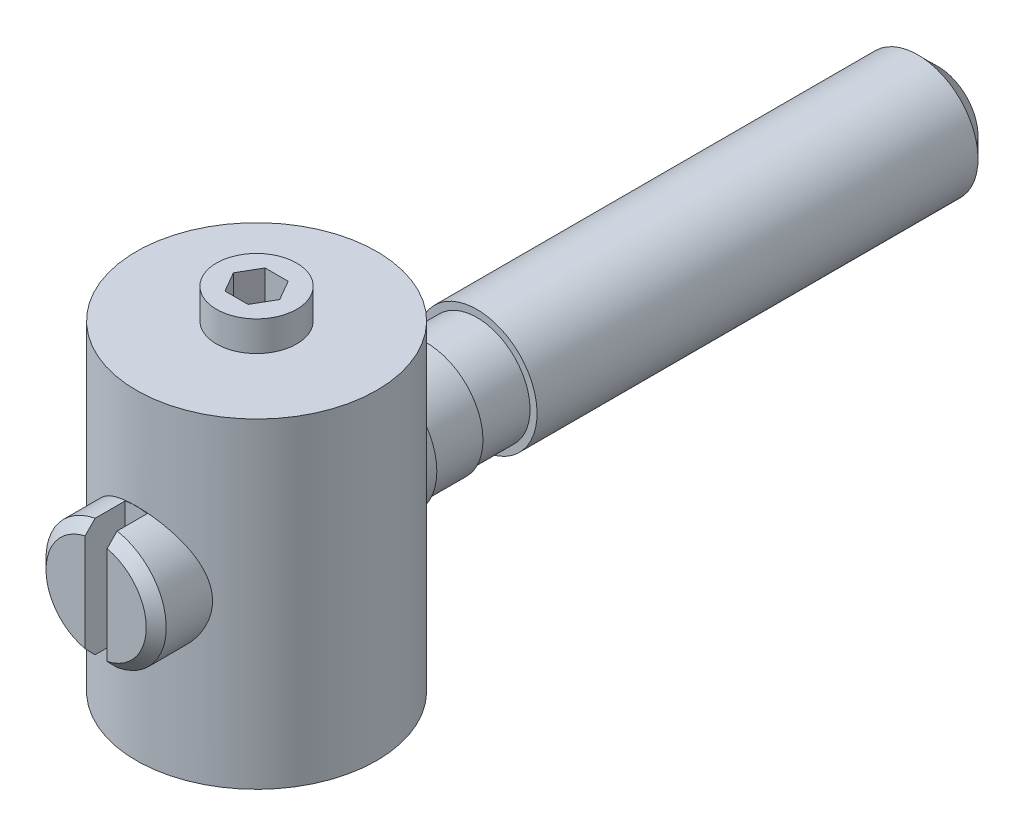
ISO-10303-21;
HEADER;
FILE_DESCRIPTION(('STEP AP214'),'2;1');
FILE_NAME('part.step','',(''),(''),'','','');
FILE_SCHEMA(('AUTOMOTIVE_DESIGN { 1 0 10303 214 1 1 1 1 }'));
ENDSEC;
DATA;
#1=APPLICATION_CONTEXT('core data for automotive mechanical design processes');
#2=APPLICATION_PROTOCOL_DEFINITION('international standard','automotive_design',2000,#1);
#3=PRODUCT_CONTEXT('',#1,'mechanical');
#4=PRODUCT('Part','Part','',(#3));
#5=PRODUCT_RELATED_PRODUCT_CATEGORY('part','',(#4));
#6=PRODUCT_DEFINITION_FORMATION('','',#4);
#7=PRODUCT_DEFINITION_CONTEXT('part definition',#1,'design');
#8=PRODUCT_DEFINITION('design','',#6,#7);
#9=PRODUCT_DEFINITION_SHAPE('','',#8);
#10=(LENGTH_UNIT() NAMED_UNIT(*) SI_UNIT(.MILLI.,.METRE.));
#11=(NAMED_UNIT(*) PLANE_ANGLE_UNIT() SI_UNIT($,.RADIAN.));
#12=(NAMED_UNIT(*) SI_UNIT($,.STERADIAN.) SOLID_ANGLE_UNIT());
#13=UNCERTAINTY_MEASURE_WITH_UNIT(LENGTH_MEASURE(1.E-05),#10,'distance_accuracy_value','');
#14=(GEOMETRIC_REPRESENTATION_CONTEXT(3) GLOBAL_UNCERTAINTY_ASSIGNED_CONTEXT((#13)) GLOBAL_UNIT_ASSIGNED_CONTEXT((#10,
#11,#12)) REPRESENTATION_CONTEXT('',''));
#15=CARTESIAN_POINT('',(0.,0.,0.));
#16=DIRECTION('',(0.,0.,1.));
#17=DIRECTION('',(1.,0.,0.));
#18=AXIS2_PLACEMENT_3D('',#15,#16,#17);
#19=CARTESIAN_POINT('',(-0.577350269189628,8.,-1.));
#20=DIRECTION('',(0.,-1.,0.));
#21=DIRECTION('',(1.,0.,0.));
#22=AXIS2_PLACEMENT_3D('',#19,#20,#21);
#23=PLANE('',#22);
#24=DIRECTION('',(-0.5,0.,0.866025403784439));
#25=VECTOR('',#24,1.);
#26=CARTESIAN_POINT('',(-0.577350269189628,8.,-1.));
#27=LINE('',#26,#25);
#28=CARTESIAN_POINT('',(-0.577350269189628,8.,-1.));
#29=VERTEX_POINT('',#28);
#30=CARTESIAN_POINT('',(-1.15470053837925,8.,0.));
#31=VERTEX_POINT('',#30);
#32=EDGE_CURVE('E366',#29,#31,#27,.T.);
#33=ORIENTED_EDGE('',*,*,#32,.T.);
#34=DIRECTION('',(0.5,0.,0.866025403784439));
#35=VECTOR('',#34,1.);
#36=CARTESIAN_POINT('',(-1.15470053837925,8.,0.));
#37=LINE('',#36,#35);
#38=CARTESIAN_POINT('',(-0.577350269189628,8.,1.));
#39=VERTEX_POINT('',#38);
#40=EDGE_CURVE('E363',#31,#39,#37,.T.);
#41=ORIENTED_EDGE('',*,*,#40,.T.);
#42=DIRECTION('',(1.,0.,0.));
#43=VECTOR('',#42,1.);
#44=CARTESIAN_POINT('',(-0.577350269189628,8.,1.));
#45=LINE('',#44,#43);
#46=CARTESIAN_POINT('',(0.577350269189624,8.,1.));
#47=VERTEX_POINT('',#46);
#48=EDGE_CURVE('E360',#39,#47,#45,.T.);
#49=ORIENTED_EDGE('',*,*,#48,.T.);
#50=DIRECTION('',(0.5,0.,-0.866025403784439));
#51=VECTOR('',#50,1.);
#52=CARTESIAN_POINT('',(0.577350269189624,8.,1.));
#53=LINE('',#52,#51);
#54=CARTESIAN_POINT('',(1.15470053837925,8.,0.));
#55=VERTEX_POINT('',#54);
#56=EDGE_CURVE('E357',#47,#55,#53,.T.);
#57=ORIENTED_EDGE('',*,*,#56,.T.);
#58=DIRECTION('',(-0.5,0.,-0.866025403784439));
#59=VECTOR('',#58,1.);
#60=CARTESIAN_POINT('',(1.15470053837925,8.,0.));
#61=LINE('',#60,#59);
#62=CARTESIAN_POINT('',(0.577350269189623,8.,-1.));
#63=VERTEX_POINT('',#62);
#64=EDGE_CURVE('E354',#55,#63,#61,.T.);
#65=ORIENTED_EDGE('',*,*,#64,.T.);
#66=DIRECTION('',(-1.,0.,0.));
#67=VECTOR('',#66,1.);
#68=CARTESIAN_POINT('',(0.577350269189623,8.,-1.));
#69=LINE('',#68,#67);
#70=EDGE_CURVE('E342',#63,#29,#69,.T.);
#71=ORIENTED_EDGE('',*,*,#70,.T.);
#72=EDGE_LOOP('',(#33,#41,#49,#57,#65,#71));
#73=FACE_BOUND('',#72,.T.);
#74=ADVANCED_FACE('F14',(#73),#23,.F.);
#75=CARTESIAN_POINT('',(-0.577350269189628,8.,1.));
#76=DIRECTION('',(0.,0.,1.));
#77=DIRECTION('',(1.,0.,0.));
#78=AXIS2_PLACEMENT_3D('',#75,#76,#77);
#79=PLANE('',#78);
#80=DIRECTION('',(1.,0.,0.));
#81=VECTOR('',#80,1.);
#82=CARTESIAN_POINT('',(-0.577350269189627,9.5,1.));
#83=LINE('',#82,#81);
#84=CARTESIAN_POINT('',(-0.577350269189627,9.5,1.));
#85=VERTEX_POINT('',#84);
#86=CARTESIAN_POINT('',(0.577350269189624,9.5,1.));
#87=VERTEX_POINT('',#86);
#88=EDGE_CURVE('E378',#85,#87,#83,.T.);
#89=ORIENTED_EDGE('',*,*,#88,.T.);
#90=DIRECTION('',(0.,1.,0.));
#91=VECTOR('',#90,1.);
#92=CARTESIAN_POINT('',(0.577350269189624,8.,1.));
#93=LINE('',#92,#91);
#94=EDGE_CURVE('E345',#47,#87,#93,.T.);
#95=ORIENTED_EDGE('',*,*,#94,.F.);
#96=ORIENTED_EDGE('',*,*,#48,.F.);
#97=DIRECTION('',(0.,1.,0.));
#98=VECTOR('',#97,1.);
#99=CARTESIAN_POINT('',(-0.577350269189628,8.,1.));
#100=LINE('',#99,#98);
#101=EDGE_CURVE('E343',#39,#85,#100,.T.);
#102=ORIENTED_EDGE('',*,*,#101,.T.);
#103=EDGE_LOOP('',(#89,#95,#96,#102));
#104=FACE_BOUND('',#103,.T.);
#105=ADVANCED_FACE('F615',(#104),#79,.F.);
#106=CARTESIAN_POINT('',(0.577350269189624,8.,1.));
#107=DIRECTION('',(0.866025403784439,0.,0.5));
#108=DIRECTION('',(0.5,0.,-0.866025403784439));
#109=AXIS2_PLACEMENT_3D('',#106,#107,#108);
#110=PLANE('',#109);
#111=DIRECTION('',(0.5,0.,-0.866025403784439));
#112=VECTOR('',#111,1.);
#113=CARTESIAN_POINT('',(0.577350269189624,9.5,1.));
#114=LINE('',#113,#112);
#115=CARTESIAN_POINT('',(1.15470053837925,9.5,0.));
#116=VERTEX_POINT('',#115);
#117=EDGE_CURVE('E375',#87,#116,#114,.T.);
#118=ORIENTED_EDGE('',*,*,#117,.T.);
#119=DIRECTION('',(0.,1.,0.));
#120=VECTOR('',#119,1.);
#121=CARTESIAN_POINT('',(1.15470053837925,8.,0.));
#122=LINE('',#121,#120);
#123=EDGE_CURVE('E347',#55,#116,#122,.T.);
#124=ORIENTED_EDGE('',*,*,#123,.F.);
#125=ORIENTED_EDGE('',*,*,#56,.F.);
#126=ORIENTED_EDGE('',*,*,#94,.T.);
#127=EDGE_LOOP('',(#118,#124,#125,#126));
#128=FACE_BOUND('',#127,.T.);
#129=ADVANCED_FACE('F624',(#128),#110,.F.);
#130=CARTESIAN_POINT('',(1.15470053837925,8.,0.));
#131=DIRECTION('',(0.866025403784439,0.,-0.5));
#132=DIRECTION('',(-0.5,0.,-0.866025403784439));
#133=AXIS2_PLACEMENT_3D('',#130,#131,#132);
#134=PLANE('',#133);
#135=DIRECTION('',(-0.5,0.,-0.866025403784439));
#136=VECTOR('',#135,1.);
#137=CARTESIAN_POINT('',(1.15470053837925,9.5,0.));
#138=LINE('',#137,#136);
#139=CARTESIAN_POINT('',(0.577350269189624,9.5,-1.));
#140=VERTEX_POINT('',#139);
#141=EDGE_CURVE('E372',#116,#140,#138,.T.);
#142=ORIENTED_EDGE('',*,*,#141,.T.);
#143=DIRECTION('',(0.,1.,0.));
#144=VECTOR('',#143,1.);
#145=CARTESIAN_POINT('',(0.577350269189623,8.,-1.));
#146=LINE('',#145,#144);
#147=EDGE_CURVE('E349',#63,#140,#146,.T.);
#148=ORIENTED_EDGE('',*,*,#147,.F.);
#149=ORIENTED_EDGE('',*,*,#64,.F.);
#150=ORIENTED_EDGE('',*,*,#123,.T.);
#151=EDGE_LOOP('',(#142,#148,#149,#150));
#152=FACE_BOUND('',#151,.T.);
#153=ADVANCED_FACE('F634',(#152),#134,.F.);
#154=CARTESIAN_POINT('',(0.577350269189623,8.,-1.));
#155=DIRECTION('',(0.,0.,-1.));
#156=DIRECTION('',(-1.,0.,0.));
#157=AXIS2_PLACEMENT_3D('',#154,#155,#156);
#158=PLANE('',#157);
#159=DIRECTION('',(-1.,0.,0.));
#160=VECTOR('',#159,1.);
#161=CARTESIAN_POINT('',(0.577350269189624,9.5,-1.));
#162=LINE('',#161,#160);
#163=CARTESIAN_POINT('',(-0.577350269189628,9.5,-1.));
#164=VERTEX_POINT('',#163);
#165=EDGE_CURVE('E369',#140,#164,#162,.T.);
#166=ORIENTED_EDGE('',*,*,#165,.T.);
#167=DIRECTION('',(0.,1.,0.));
#168=VECTOR('',#167,1.);
#169=CARTESIAN_POINT('',(-0.577350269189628,8.,-1.));
#170=LINE('',#169,#168);
#171=EDGE_CURVE('E337',#29,#164,#170,.T.);
#172=ORIENTED_EDGE('',*,*,#171,.F.);
#173=ORIENTED_EDGE('',*,*,#70,.F.);
#174=ORIENTED_EDGE('',*,*,#147,.T.);
#175=EDGE_LOOP('',(#166,#172,#173,#174));
#176=FACE_BOUND('',#175,.T.);
#177=ADVANCED_FACE('F644',(#176),#158,.F.);
#178=CARTESIAN_POINT('',(-0.577350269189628,8.,-1.));
#179=DIRECTION('',(-0.866025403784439,0.,-0.5));
#180=DIRECTION('',(-0.5,0.,0.866025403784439));
#181=AXIS2_PLACEMENT_3D('',#178,#179,#180);
#182=PLANE('',#181);
#183=DIRECTION('',(-0.5,0.,0.866025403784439));
#184=VECTOR('',#183,1.);
#185=CARTESIAN_POINT('',(-0.577350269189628,9.5,-1.));
#186=LINE('',#185,#184);
#187=CARTESIAN_POINT('',(-1.15470053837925,9.5,0.));
#188=VERTEX_POINT('',#187);
#189=EDGE_CURVE('E87',#164,#188,#186,.T.);
#190=ORIENTED_EDGE('',*,*,#189,.T.);
#191=DIRECTION('',(0.,1.,0.));
#192=VECTOR('',#191,1.);
#193=CARTESIAN_POINT('',(-1.15470053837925,8.,0.));
#194=LINE('',#193,#192);
#195=EDGE_CURVE('E340',#31,#188,#194,.T.);
#196=ORIENTED_EDGE('',*,*,#195,.F.);
#197=ORIENTED_EDGE('',*,*,#32,.F.);
#198=ORIENTED_EDGE('',*,*,#171,.T.);
#199=EDGE_LOOP('',(#190,#196,#197,#198));
#200=FACE_BOUND('',#199,.T.);
#201=ADVANCED_FACE('F654',(#200),#182,.F.);
#202=CARTESIAN_POINT('',(-1.15470053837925,8.,0.));
#203=DIRECTION('',(-0.866025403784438,0.,0.5));
#204=DIRECTION('',(0.5,0.,0.866025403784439));
#205=AXIS2_PLACEMENT_3D('',#202,#203,#204);
#206=PLANE('',#205);
#207=DIRECTION('',(0.5,0.,0.866025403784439));
#208=VECTOR('',#207,1.);
#209=CARTESIAN_POINT('',(-1.15470053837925,9.5,0.));
#210=LINE('',#209,#208);
#211=EDGE_CURVE('E381',#188,#85,#210,.T.);
#212=ORIENTED_EDGE('',*,*,#211,.T.);
#213=ORIENTED_EDGE('',*,*,#101,.F.);
#214=ORIENTED_EDGE('',*,*,#40,.F.);
#215=ORIENTED_EDGE('',*,*,#195,.T.);
#216=EDGE_LOOP('',(#212,#213,#214,#215));
#217=FACE_BOUND('',#216,.T.);
#218=ADVANCED_FACE('F663',(#217),#206,.F.);
#219=CARTESIAN_POINT('',(0.,9.5,0.));
#220=DIRECTION('',(0.,-1.,0.));
#221=DIRECTION('',(1.,0.,0.));
#222=AXIS2_PLACEMENT_3D('',#219,#220,#221);
#223=PLANE('',#222);
#224=ORIENTED_EDGE('',*,*,#211,.F.);
#225=ORIENTED_EDGE('',*,*,#189,.F.);
#226=ORIENTED_EDGE('',*,*,#165,.F.);
#227=ORIENTED_EDGE('',*,*,#141,.F.);
#228=ORIENTED_EDGE('',*,*,#117,.F.);
#229=ORIENTED_EDGE('',*,*,#88,.F.);
#230=EDGE_LOOP('',(#224,#225,#226,#227,#228,#229));
#231=FACE_BOUND('',#230,.T.);
#232=CARTESIAN_POINT('',(0.,9.5,0.));
#233=DIRECTION('',(0.,-1.,0.));
#234=DIRECTION('',(1.,0.,0.));
#235=AXIS2_PLACEMENT_3D('',#232,#233,#234);
#236=CIRCLE('',#235,2.);
#237=CARTESIAN_POINT('',(2.,9.5,0.));
#238=VERTEX_POINT('',#237);
#239=EDGE_CURVE('E332',#238,#238,#236,.T.);
#240=ORIENTED_EDGE('',*,*,#239,.F.);
#241=EDGE_LOOP('',(#240));
#242=FACE_BOUND('',#241,.T.);
#243=ADVANCED_FACE('F409',(#231,#242),#223,.F.);
#244=CARTESIAN_POINT('',(0.,5.5,0.));
#245=DIRECTION('',(0.,-1.,0.));
#246=DIRECTION('',(1.,0.,0.));
#247=AXIS2_PLACEMENT_3D('',#244,#245,#246);
#248=CYLINDRICAL_SURFACE('',#247,2.);
#249=ORIENTED_EDGE('',*,*,#239,.T.);
#250=EDGE_LOOP('',(#249));
#251=FACE_BOUND('',#250,.T.);
#252=CARTESIAN_POINT('',(0.,8.,0.));
#253=DIRECTION('',(0.,-1.,0.));
#254=DIRECTION('',(1.,0.,0.));
#255=AXIS2_PLACEMENT_3D('',#252,#253,#254);
#256=CIRCLE('',#255,2.);
#257=CARTESIAN_POINT('',(2.,8.,0.));
#258=VERTEX_POINT('',#257);
#259=EDGE_CURVE('E330',#258,#258,#256,.T.);
#260=ORIENTED_EDGE('',*,*,#259,.F.);
#261=EDGE_LOOP('',(#260));
#262=FACE_BOUND('',#261,.T.);
#263=ADVANCED_FACE('F403',(#251,#262),#248,.T.);
#264=CARTESIAN_POINT('',(0.,8.,0.));
#265=DIRECTION('',(0.,-1.,0.));
#266=DIRECTION('',(1.,0.,0.));
#267=AXIS2_PLACEMENT_3D('',#264,#265,#266);
#268=PLANE('',#267);
#269=CARTESIAN_POINT('',(0.,8.,0.));
#270=DIRECTION('',(0.,-1.,0.));
#271=DIRECTION('',(1.,0.,0.));
#272=AXIS2_PLACEMENT_3D('',#269,#270,#271);
#273=CIRCLE('',#272,6.);
#274=CARTESIAN_POINT('',(6.,8.,0.));
#275=VERTEX_POINT('',#274);
#276=EDGE_CURVE('E387',#275,#275,#273,.T.);
#277=ORIENTED_EDGE('',*,*,#276,.F.);
#278=EDGE_LOOP('',(#277));
#279=FACE_BOUND('',#278,.T.);
#280=ORIENTED_EDGE('',*,*,#259,.T.);
#281=EDGE_LOOP('',(#280));
#282=FACE_BOUND('',#281,.T.);
#283=ADVANCED_FACE('F397',(#279,#282),#268,.F.);
#284=CARTESIAN_POINT('',(0.,-8.,0.));
#285=DIRECTION('',(0.,-1.,0.));
#286=DIRECTION('',(1.,0.,0.));
#287=AXIS2_PLACEMENT_3D('',#284,#285,#286);
#288=PLANE('',#287);
#289=CARTESIAN_POINT('',(0.,-8.,0.));
#290=DIRECTION('',(0.,-1.,0.));
#291=DIRECTION('',(1.,0.,0.));
#292=AXIS2_PLACEMENT_3D('',#289,#290,#291);
#293=CIRCLE('',#292,6.);
#294=CARTESIAN_POINT('',(6.,-8.,0.));
#295=VERTEX_POINT('',#294);
#296=EDGE_CURVE('E385',#295,#295,#293,.T.);
#297=ORIENTED_EDGE('',*,*,#296,.T.);
#298=EDGE_LOOP('',(#297));
#299=FACE_BOUND('',#298,.T.);
#300=ADVANCED_FACE('F257',(#299),#288,.T.);
#301=CARTESIAN_POINT('',(0.,-8.,0.));
#302=DIRECTION('',(0.,1.,0.));
#303=DIRECTION('',(-1.,0.,0.));
#304=AXIS2_PLACEMENT_3D('',#301,#302,#303);
#305=CYLINDRICAL_SURFACE('',#304,6.);
#306=CARTESIAN_POINT('',(0.,-3.,6.));
#307=CARTESIAN_POINT('',(0.0788941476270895,-2.99999916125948,5.99999934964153));
#308=CARTESIAN_POINT('',(0.157796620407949,-2.99688205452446,5.99843869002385));
#309=CARTESIAN_POINT('',(0.315001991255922,-2.98446072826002,5.99224358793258));
#310=CARTESIAN_POINT('',(0.393304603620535,-2.97515372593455,5.98760776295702));
#311=CARTESIAN_POINT('',(0.626628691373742,-2.93804214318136,5.96921978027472));
#312=CARTESIAN_POINT('',(0.779952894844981,-2.90104717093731,5.95098734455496));
#313=CARTESIAN_POINT('',(1.07683586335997,-2.80441822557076,5.90448966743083));
#314=CARTESIAN_POINT('',(1.22043005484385,-2.74487223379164,5.87626344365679));
#315=CARTESIAN_POINT('',(1.49540820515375,-2.60528874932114,5.81237302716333));
#316=CARTESIAN_POINT('',(1.62679312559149,-2.52525287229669,5.77670942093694));
#317=CARTESIAN_POINT('',(1.88252701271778,-2.34144601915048,5.69868752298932));
#318=CARTESIAN_POINT('',(2.0059694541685,-2.23653205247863,5.65605474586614));
#319=CARTESIAN_POINT('',(2.23433451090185,-2.00844407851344,5.5698003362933));
#320=CARTESIAN_POINT('',(2.3392430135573,-1.88525628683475,5.52617797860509));
#321=CARTESIAN_POINT('',(2.53576864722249,-1.61251563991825,5.43896347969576));
#322=CARTESIAN_POINT('',(2.62572411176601,-1.46165902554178,5.39563602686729));
#323=CARTESIAN_POINT('',(2.7403403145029,-1.22404914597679,5.33782449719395));
#324=CARTESIAN_POINT('',(2.77516786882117,-1.14292907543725,5.31974570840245));
#325=CARTESIAN_POINT('',(2.83769299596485,-0.977399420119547,5.28665768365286));
#326=CARTESIAN_POINT('',(2.86539478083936,-0.892991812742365,5.27164663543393));
#327=CARTESIAN_POINT('',(2.91188280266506,-0.72660420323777,5.24610341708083));
#328=CARTESIAN_POINT('',(2.93110042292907,-0.644777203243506,5.23535838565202));
#329=CARTESIAN_POINT('',(2.9626355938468,-0.479445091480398,5.21757784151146));
#330=CARTESIAN_POINT('',(2.97495680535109,-0.395940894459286,5.21054036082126));
#331=CARTESIAN_POINT('',(2.99251382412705,-0.227993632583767,5.20047756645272));
#332=CARTESIAN_POINT('',(2.99775389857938,-0.143551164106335,5.19744983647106));
#333=CARTESIAN_POINT('',(3.00108452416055,0.0254936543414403,5.19552555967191));
#334=CARTESIAN_POINT('',(2.99917575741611,0.11009598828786,5.19662861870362));
#335=CARTESIAN_POINT('',(2.98404973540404,0.342753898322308,5.20534668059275));
#336=CARTESIAN_POINT('',(2.96335042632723,0.490244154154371,5.21726794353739));
#337=CARTESIAN_POINT('',(2.90082280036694,0.779193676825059,5.25228182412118));
#338=CARTESIAN_POINT('',(2.85898775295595,0.920651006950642,5.2753780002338));
#339=CARTESIAN_POINT('',(2.75462843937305,1.19767965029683,5.33062568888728));
#340=CARTESIAN_POINT('',(2.69164495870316,1.33303711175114,5.36297559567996));
#341=CARTESIAN_POINT('',(2.54712530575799,1.59190496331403,5.43310175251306));
#342=CARTESIAN_POINT('',(2.46558080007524,1.71540999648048,5.47088043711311));
#343=CARTESIAN_POINT('',(2.27419808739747,1.96356309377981,5.55339485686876));
#344=CARTESIAN_POINT('',(2.16208335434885,2.0863704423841,5.59840533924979));
#345=CARTESIAN_POINT('',(1.91866675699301,2.31220643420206,5.6864286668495));
#346=CARTESIAN_POINT('',(1.78735577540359,2.41522562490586,5.72944054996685));
#347=CARTESIAN_POINT('',(1.50154951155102,2.60305693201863,5.81105962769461));
#348=CARTESIAN_POINT('',(1.3462607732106,2.68680140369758,5.84936952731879));
#349=CARTESIAN_POINT('',(1.02139864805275,2.82629110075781,5.91473643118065));
#350=CARTESIAN_POINT('',(0.851836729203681,2.88205855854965,5.94180236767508));
#351=CARTESIAN_POINT('',(0.518299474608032,2.95942620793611,5.97973001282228));
#352=CARTESIAN_POINT('',(0.355024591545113,2.98347370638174,5.99174814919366));
#353=CARTESIAN_POINT('',(0.026338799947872,3.00439419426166,6.00219040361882));
#354=CARTESIAN_POINT('',(-0.13907105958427,3.00128005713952,6.00062096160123));
#355=CARTESIAN_POINT('',(-0.453698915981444,2.96937993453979,5.98473576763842));
#356=CARTESIAN_POINT('',(-0.60317822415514,2.94260240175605,5.97141737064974));
#357=CARTESIAN_POINT('',(-0.895220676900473,2.86728578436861,5.93466513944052));
#358=CARTESIAN_POINT('',(-1.03778305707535,2.81874430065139,5.91123019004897));
#359=CARTESIAN_POINT('',(-1.31666582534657,2.7000046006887,5.85552754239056));
#360=CARTESIAN_POINT('',(-1.45269119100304,2.62922684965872,5.82302645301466));
#361=CARTESIAN_POINT('',(-1.71138408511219,2.46867739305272,5.75231922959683));
#362=CARTESIAN_POINT('',(-1.83404588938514,2.37889759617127,5.71411066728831));
#363=CARTESIAN_POINT('',(-2.07530306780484,2.17271872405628,5.63124663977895));
#364=CARTESIAN_POINT('',(-2.19231623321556,2.05457139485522,5.58632654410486));
#365=CARTESIAN_POINT('',(-2.40556896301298,1.8002245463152,5.49787174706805));
#366=CARTESIAN_POINT('',(-2.50179415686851,1.66401264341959,5.45433802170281));
#367=CARTESIAN_POINT('',(-2.675123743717,1.36906903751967,5.3715357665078));
#368=CARTESIAN_POINT('',(-2.75107648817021,1.20956620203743,5.33257588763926));
#369=CARTESIAN_POINT('',(-2.87424847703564,0.877469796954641,5.26722216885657));
#370=CARTESIAN_POINT('',(-2.92150474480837,0.704893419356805,5.24081214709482));
#371=CARTESIAN_POINT('',(-2.98158506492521,0.369269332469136,5.2068450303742));
#372=CARTESIAN_POINT('',(-2.997278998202,0.206897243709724,5.19772150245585));
#373=CARTESIAN_POINT('',(-3.00206745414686,-0.118341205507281,5.19496064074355));
#374=CARTESIAN_POINT('',(-2.99117350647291,-0.281207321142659,5.20131659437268));
#375=CARTESIAN_POINT('',(-2.94577840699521,-0.586450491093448,5.227135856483));
#376=CARTESIAN_POINT('',(-2.91362505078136,-0.72930136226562,5.24529281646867));
#377=CARTESIAN_POINT('',(-2.82952596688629,-1.0074244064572,5.29113050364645));
#378=CARTESIAN_POINT('',(-2.77757387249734,-1.14269412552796,5.3188142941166));
#379=CARTESIAN_POINT('',(-2.65144766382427,-1.41187436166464,5.38285583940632));
#380=CARTESIAN_POINT('',(-2.57601505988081,-1.54508296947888,5.41967139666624));
#381=CARTESIAN_POINT('',(-2.40645126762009,-1.79782434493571,5.49706022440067));
#382=CARTESIAN_POINT('',(-2.31231035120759,-1.9173499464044,5.53763544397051));
#383=CARTESIAN_POINT('',(-2.094616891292,-2.15442285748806,5.62386853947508));
#384=CARTESIAN_POINT('',(-1.96888052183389,-2.2699651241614,5.66954494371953));
#385=CARTESIAN_POINT('',(-1.69843715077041,-2.47880114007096,5.75633712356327));
#386=CARTESIAN_POINT('',(-1.55371998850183,-2.57208289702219,5.79745043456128));
#387=CARTESIAN_POINT('',(-1.32452333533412,-2.69317818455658,5.85251406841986));
#388=CARTESIAN_POINT('',(-1.24575314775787,-2.73052020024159,5.86982524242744));
#389=CARTESIAN_POINT('',(-1.08479725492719,-2.79836167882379,5.90168845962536));
#390=CARTESIAN_POINT('',(-1.00261324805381,-2.82886449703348,5.91624185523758));
#391=CARTESIAN_POINT('',(-0.835616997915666,-2.88260725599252,5.94212690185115));
#392=CARTESIAN_POINT('',(-0.750810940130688,-2.90586304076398,5.95346557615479));
#393=CARTESIAN_POINT('',(-0.579142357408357,-2.94488257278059,5.97260771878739));
#394=CARTESIAN_POINT('',(-0.492281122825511,-2.96065089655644,5.9804133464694));
#395=CARTESIAN_POINT('',(-0.337824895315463,-2.98168467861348,5.99085829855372));
#396=CARTESIAN_POINT('',(-0.270495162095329,-2.98854691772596,5.99428035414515));
#397=CARTESIAN_POINT('',(-0.13544567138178,-2.99770500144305,5.99885151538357));
#398=CARTESIAN_POINT('',(-0.067725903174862,-3.00000072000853,6.00000055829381));
#399=CARTESIAN_POINT('',(0.,-3.,6.));
#400=B_SPLINE_CURVE_WITH_KNOTS('',3,(#306,#307,#308,#309,#310,#311,#312,#313,#314,#315,#316,
#317,#318,#319,#320,#321,#322,#323,#324,#325,#326,#327,#328,#329,#330,#331,#332,#333,#334,#335,
#336,#337,#338,#339,#340,#341,#342,#343,#344,#345,#346,#347,#348,#349,#350,#351,#352,#353,#354,
#355,#356,#357,#358,#359,#360,#361,#362,#363,#364,#365,#366,#367,#368,#369,#370,#371,#372,#373,
#374,#375,#376,#377,#378,#379,#380,#381,#382,#383,#384,#385,#386,#387,#388,#389,#390,#391,#392,
#393,#394,#395,#396,#397,#398,#399),.UNSPECIFIED.,.T.,.F.,(4,2,2,2,2,2,2,2,2,2,2,2,2,2,2,2,2,2,
2,2,2,2,2,2,2,2,2,2,2,2,2,2,2,2,2,2,2,2,2,2,2,2,2,2,2,2,4),(0.,0.236611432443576,
0.4733293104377,0.947100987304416,1.41904300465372,1.89094781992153,2.39140181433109,
2.89223525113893,3.4319083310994,3.70192714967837,3.97178599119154,4.2256372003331,
4.47935352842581,4.73291689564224,4.98645606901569,5.43238672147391,5.87845946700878,
6.33492255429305,6.79159098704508,7.30616358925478,7.82098138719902,8.35970601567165,
8.89800185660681,9.3917140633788,9.88519228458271,10.3404225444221,10.7957029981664,
11.2640010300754,11.7324988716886,12.2470036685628,12.7618630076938,13.3016558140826,
13.8407507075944,14.3280945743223,14.8152271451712,15.2559532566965,15.6968212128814,
16.1673090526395,16.6380421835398,17.1659726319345,17.6941868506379,17.9605054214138,
18.2266930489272,18.4922945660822,18.7577335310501,18.9608446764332,19.1639614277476),.UNSPECIFIED.);
#401=CARTESIAN_POINT('',(0.,-3.,6.));
#402=VERTEX_POINT('',#401);
#403=EDGE_CURVE('E238',#402,#402,#400,.T.);
#404=ORIENTED_EDGE('',*,*,#403,.F.);
#405=EDGE_LOOP('',(#404));
#406=FACE_BOUND('',#405,.T.);
#407=ORIENTED_EDGE('',*,*,#296,.F.);
#408=EDGE_LOOP('',(#407));
#409=FACE_BOUND('',#408,.T.);
#410=ORIENTED_EDGE('',*,*,#276,.T.);
#411=EDGE_LOOP('',(#410));
#412=FACE_BOUND('',#411,.T.);
#413=CARTESIAN_POINT('',(-0.24944301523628,-2.98961171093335,-5.99481260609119));
#414=CARTESIAN_POINT('',(-0.330004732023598,-2.98290238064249,-5.99147459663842));
#415=CARTESIAN_POINT('',(-0.410210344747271,-2.97291932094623,-5.98649676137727));
#416=CARTESIAN_POINT('',(-0.569274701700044,-2.94659155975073,-5.97346181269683));
#417=CARTESIAN_POINT('',(-0.648134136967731,-2.93025023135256,-5.96540633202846));
#418=CARTESIAN_POINT('',(-0.803591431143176,-2.89147571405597,-5.94645720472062));
#419=CARTESIAN_POINT('',(-0.880198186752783,-2.86907155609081,-5.93557709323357));
#420=CARTESIAN_POINT('',(-1.03101013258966,-2.81839560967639,-5.91124875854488));
#421=CARTESIAN_POINT('',(-1.10521507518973,-2.79012321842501,-5.89780027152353));
#422=CARTESIAN_POINT('',(-1.32326188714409,-2.69701283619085,-5.8541309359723));
#423=CARTESIAN_POINT('',(-1.46294865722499,-2.62377717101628,-5.82053324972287));
#424=CARTESIAN_POINT('',(-1.72813965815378,-2.45726165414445,-5.7473946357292));
#425=CARTESIAN_POINT('',(-1.8536262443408,-2.36395727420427,-5.70784645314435));
#426=CARTESIAN_POINT('',(-2.09631897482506,-2.15246230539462,-5.62343784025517));
#427=CARTESIAN_POINT('',(-2.21235682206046,-2.03299902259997,-5.5783991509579));
#428=CARTESIAN_POINT('',(-2.42343129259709,-1.77613061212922,-5.49000039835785));
#429=CARTESIAN_POINT('',(-2.51845793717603,-1.63871700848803,-5.44664114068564));
#430=CARTESIAN_POINT('',(-2.68891933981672,-1.3417660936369,-5.36461418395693));
#431=CARTESIAN_POINT('',(-2.76324651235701,-1.18150009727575,-5.32625566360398));
#432=CARTESIAN_POINT('',(-2.88302999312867,-0.848170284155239,-5.26239681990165));
#433=CARTESIAN_POINT('',(-2.92852409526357,-0.675123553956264,-5.23687967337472));
#434=CARTESIAN_POINT('',(-2.985080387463,-0.339566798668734,-5.2048295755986));
#435=CARTESIAN_POINT('',(-2.9991119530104,-0.177715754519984,-5.19666371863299));
#436=CARTESIAN_POINT('',(-3.0008049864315,0.146144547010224,-5.19568908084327));
#437=CARTESIAN_POINT('',(-2.98847637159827,0.308153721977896,-5.20287452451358));
#438=CARTESIAN_POINT('',(-2.94054735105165,0.612110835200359,-5.23008745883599));
#439=CARTESIAN_POINT('',(-2.90718475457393,0.754536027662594,-5.24887684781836));
#440=CARTESIAN_POINT('',(-2.82077935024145,1.03164067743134,-5.29581030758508));
#441=CARTESIAN_POINT('',(-2.76773012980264,1.16631759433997,-5.32395742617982));
#442=CARTESIAN_POINT('',(-2.63918949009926,1.4347066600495,-5.38889663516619));
#443=CARTESIAN_POINT('',(-2.56236570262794,1.56766275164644,-5.42616261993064));
#444=CARTESIAN_POINT('',(-2.38999637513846,1.81968279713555,-5.50425868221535));
#445=CARTESIAN_POINT('',(-2.29444154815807,1.93873981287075,-5.54509052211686));
#446=CARTESIAN_POINT('',(-2.07388804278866,2.17441373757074,-5.6315760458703));
#447=CARTESIAN_POINT('',(-1.94673190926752,2.28902254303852,-5.67722023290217));
#448=CARTESIAN_POINT('',(-1.67350278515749,2.49573457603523,-5.76366699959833));
#449=CARTESIAN_POINT('',(-1.5274175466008,2.58782311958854,-5.80446641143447));
#450=CARTESIAN_POINT('',(-1.29660432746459,2.70672716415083,-5.85876618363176));
#451=CARTESIAN_POINT('',(-1.21754163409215,2.74321299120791,-5.87574440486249));
#452=CARTESIAN_POINT('',(-1.05608024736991,2.80932188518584,-5.90689721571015));
#453=CARTESIAN_POINT('',(-0.973683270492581,2.8389484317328,-5.921073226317));
#454=CARTESIAN_POINT('',(-0.806386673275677,2.89091640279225,-5.94616533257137));
#455=CARTESIAN_POINT('',(-0.721494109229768,2.91327654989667,-5.95708979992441));
#456=CARTESIAN_POINT('',(-0.549753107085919,2.95050469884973,-5.97538398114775));
#457=CARTESIAN_POINT('',(-0.4629064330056,2.96537919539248,-5.9827567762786));
#458=CARTESIAN_POINT('',(-0.354542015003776,2.97905143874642,-5.98955282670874));
#459=CARTESIAN_POINT('',(-0.333551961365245,2.98147453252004,-5.99075847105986));
#460=CARTESIAN_POINT('',(-0.291530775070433,2.98587593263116,-5.99295011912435));
#461=CARTESIAN_POINT('',(-0.270499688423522,2.98785459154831,-5.99393629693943));
#462=CARTESIAN_POINT('',(-0.24944301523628,2.98961171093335,-5.99481260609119));
#463=B_SPLINE_CURVE_WITH_KNOTS('',3,(#413,#414,#415,#416,#417,#418,#419,#420,#421,#422,#423,
#424,#425,#426,#427,#428,#429,#430,#431,#432,#433,#434,#435,#436,#437,#438,#439,#440,#441,#442,
#443,#444,#445,#446,#447,#448,#449,#450,#451,#452,#453,#454,#455,#456,#457,#458,#459,#460,#461,
#462),.UNSPECIFIED.,.F.,.F.,(4,2,2,2,2,2,2,2,2,2,2,2,2,2,2,2,2,2,2,2,2,2,2,2,4),(0.,
0.242622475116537,0.485116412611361,0.726469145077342,0.96784668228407,1.44933017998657,
1.93140553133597,2.44673475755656,2.96230820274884,3.50169408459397,4.04037147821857,
4.52558194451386,5.0106098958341,5.45115857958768,5.89185089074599,6.36402161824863,
6.83642704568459,7.3655343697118,7.89498577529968,8.16082401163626,8.42652709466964,
8.69154003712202,8.95632265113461,9.01981077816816,9.08324835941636),.UNSPECIFIED.);
#464=CARTESIAN_POINT('',(-0.249443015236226,-2.98961171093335,-5.99481260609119));
#465=VERTEX_POINT('',#464);
#466=CARTESIAN_POINT('',(-0.249443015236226,2.98961171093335,-5.99481260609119));
#467=VERTEX_POINT('',#466);
#468=EDGE_CURVE('E9',#465,#467,#463,.T.);
#469=ORIENTED_EDGE('',*,*,#468,.F.);
#470=DIRECTION('',(0.,1.,0.));
#471=VECTOR('',#470,1.);
#472=CARTESIAN_POINT('',(-0.249443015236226,-8.,-5.99481260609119));
#473=LINE('',#472,#471);
#474=CARTESIAN_POINT('',(-0.249443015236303,-2.78886682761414,-5.99481260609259));
#475=VERTEX_POINT('',#474);
#476=EDGE_CURVE('E144',#475,#465,#473,.F.);
#477=ORIENTED_EDGE('',*,*,#476,.F.);
#478=CARTESIAN_POINT('',(0.249443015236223,-2.78886682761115,-5.99481260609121));
#479=CARTESIAN_POINT('',(0.228607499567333,-2.7907304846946,-5.99567959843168));
#480=CARTESIAN_POINT('',(0.207746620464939,-2.79236089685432,-5.99643870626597));
#481=CARTESIAN_POINT('',(0.16602502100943,-2.79515149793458,-5.99773876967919));
#482=CARTESIAN_POINT('',(0.145164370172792,-2.79631254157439,-5.99828012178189));
#483=CARTESIAN_POINT('',(0.103453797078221,-2.79816589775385,-5.99914472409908));
#484=CARTESIAN_POINT('',(0.0826039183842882,-2.79885901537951,-5.99946834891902));
#485=CARTESIAN_POINT('',(0.04116925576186,-2.7997729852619,-5.99989478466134));
#486=CARTESIAN_POINT('',(0.0205846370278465,-2.80000000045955,-6.00000047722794));
#487=CARTESIAN_POINT('',(-0.0209746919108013,-2.79999999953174,-5.99999951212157));
#488=CARTESIAN_POINT('',(-0.0419494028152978,-2.79976429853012,-5.99988879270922));
#489=CARTESIAN_POINT('',(-0.083660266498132,-2.79882679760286,-5.99945066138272));
#490=CARTESIAN_POINT('',(-0.104396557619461,-2.79813004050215,-5.9991255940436));
#491=CARTESIAN_POINT('',(-0.145863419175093,-2.79627519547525,-5.99826105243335));
#492=CARTESIAN_POINT('',(-0.166593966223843,-2.79511667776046,-5.99772137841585));
#493=CARTESIAN_POINT('',(-0.208039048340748,-2.79233802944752,-5.99642770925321));
#494=CARTESIAN_POINT('',(-0.228753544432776,-2.79071742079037,-5.99567349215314));
#495=CARTESIAN_POINT('',(-0.249443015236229,-2.78886682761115,-5.99481260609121));
#496=B_SPLINE_CURVE_WITH_KNOTS('',3,(#478,#479,#480,#481,#482,#483,#484,#485,#486,#487,#488,
#489,#490,#491,#492,#493,#494,#495),.UNSPECIFIED.,.F.,.F.,(4,2,2,2,2,2,2,2,4),(0.,
0.0628083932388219,0.125501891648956,0.188087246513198,0.249839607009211,0.312762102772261,
0.375007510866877,0.437310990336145,0.499679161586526),.UNSPECIFIED.);
#497=CARTESIAN_POINT('',(0.249443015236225,-2.78886682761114,-5.99481260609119));
#498=VERTEX_POINT('',#497);
#499=EDGE_CURVE('E145',#498,#475,#496,.T.);
#500=ORIENTED_EDGE('',*,*,#499,.F.);
#501=DIRECTION('',(0.,1.,0.));
#502=VECTOR('',#501,1.);
#503=CARTESIAN_POINT('',(0.249443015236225,-8.,-5.99481260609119));
#504=LINE('',#503,#502);
#505=CARTESIAN_POINT('',(0.24944301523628,-2.98961171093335,-5.99481260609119));
#506=VERTEX_POINT('',#505);
#507=EDGE_CURVE('E274',#506,#498,#504,.T.);
#508=ORIENTED_EDGE('',*,*,#507,.F.);
#509=CARTESIAN_POINT('',(0.24944301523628,2.98961171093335,-5.99481260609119));
#510=CARTESIAN_POINT('',(0.330004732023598,2.9829023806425,-5.99147459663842));
#511=CARTESIAN_POINT('',(0.410210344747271,2.97291932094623,-5.98649676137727));
#512=CARTESIAN_POINT('',(0.569274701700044,2.94659155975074,-5.97346181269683));
#513=CARTESIAN_POINT('',(0.648134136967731,2.93025023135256,-5.96540633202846));
#514=CARTESIAN_POINT('',(0.803591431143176,2.89147571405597,-5.94645720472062));
#515=CARTESIAN_POINT('',(0.880198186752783,2.86907155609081,-5.93557709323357));
#516=CARTESIAN_POINT('',(1.03101013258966,2.81839560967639,-5.91124875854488));
#517=CARTESIAN_POINT('',(1.10521507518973,2.79012321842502,-5.89780027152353));
#518=CARTESIAN_POINT('',(1.32326188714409,2.69701283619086,-5.8541309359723));
#519=CARTESIAN_POINT('',(1.462948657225,2.62377717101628,-5.82053324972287));
#520=CARTESIAN_POINT('',(1.72813965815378,2.45726165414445,-5.7473946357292));
#521=CARTESIAN_POINT('',(1.8536262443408,2.36395727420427,-5.70784645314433));
#522=CARTESIAN_POINT('',(2.09631897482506,2.15246230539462,-5.62343784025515));
#523=CARTESIAN_POINT('',(2.21235682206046,2.03299902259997,-5.57839915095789));
#524=CARTESIAN_POINT('',(2.42343129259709,1.77613061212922,-5.49000039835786));
#525=CARTESIAN_POINT('',(2.51845793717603,1.63871700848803,-5.44664114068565));
#526=CARTESIAN_POINT('',(2.68891933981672,1.34176609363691,-5.36461418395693));
#527=CARTESIAN_POINT('',(2.76324651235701,1.18150009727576,-5.32625566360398));
#528=CARTESIAN_POINT('',(2.88302999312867,0.84817028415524,-5.26239681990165));
#529=CARTESIAN_POINT('',(2.92852409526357,0.675123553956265,-5.23687967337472));
#530=CARTESIAN_POINT('',(2.985080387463,0.339566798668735,-5.2048295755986));
#531=CARTESIAN_POINT('',(2.9991119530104,0.177715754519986,-5.19666371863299));
#532=CARTESIAN_POINT('',(3.0008049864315,-0.146144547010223,-5.19568908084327));
#533=CARTESIAN_POINT('',(2.98847637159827,-0.308153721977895,-5.20287452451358));
#534=CARTESIAN_POINT('',(2.94054735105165,-0.612110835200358,-5.23008745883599));
#535=CARTESIAN_POINT('',(2.90718475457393,-0.754536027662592,-5.24887684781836));
#536=CARTESIAN_POINT('',(2.82077935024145,-1.03164067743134,-5.29581030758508));
#537=CARTESIAN_POINT('',(2.76773012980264,-1.16631759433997,-5.32395742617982));
#538=CARTESIAN_POINT('',(2.63918949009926,-1.4347066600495,-5.38889663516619));
#539=CARTESIAN_POINT('',(2.56236570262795,-1.56766275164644,-5.42616261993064));
#540=CARTESIAN_POINT('',(2.38999637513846,-1.81968279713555,-5.50425868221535));
#541=CARTESIAN_POINT('',(2.29444154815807,-1.93873981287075,-5.54509052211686));
#542=CARTESIAN_POINT('',(2.07388804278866,-2.17441373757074,-5.6315760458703));
#543=CARTESIAN_POINT('',(1.94673190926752,-2.28902254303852,-5.67722023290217));
#544=CARTESIAN_POINT('',(1.67350278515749,-2.49573457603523,-5.76366699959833));
#545=CARTESIAN_POINT('',(1.5274175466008,-2.58782311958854,-5.80446641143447));
#546=CARTESIAN_POINT('',(1.29660432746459,-2.70672716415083,-5.85876618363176));
#547=CARTESIAN_POINT('',(1.21754163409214,-2.7432129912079,-5.87574440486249));
#548=CARTESIAN_POINT('',(1.0560802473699,-2.80932188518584,-5.90689721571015));
#549=CARTESIAN_POINT('',(0.973683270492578,-2.8389484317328,-5.921073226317));
#550=CARTESIAN_POINT('',(0.806386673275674,-2.89091640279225,-5.94616533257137));
#551=CARTESIAN_POINT('',(0.721494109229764,-2.91327654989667,-5.95708979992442));
#552=CARTESIAN_POINT('',(0.549753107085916,-2.95050469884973,-5.97538398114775));
#553=CARTESIAN_POINT('',(0.462906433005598,-2.96537919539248,-5.9827567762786));
#554=CARTESIAN_POINT('',(0.354542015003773,-2.97905143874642,-5.98955282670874));
#555=CARTESIAN_POINT('',(0.333551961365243,-2.98147453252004,-5.99075847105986));
#556=CARTESIAN_POINT('',(0.291530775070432,-2.98587593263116,-5.99295011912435));
#557=CARTESIAN_POINT('',(0.270499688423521,-2.9878545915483,-5.99393629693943));
#558=CARTESIAN_POINT('',(0.24944301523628,-2.98961171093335,-5.99481260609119));
#559=B_SPLINE_CURVE_WITH_KNOTS('',3,(#509,#510,#511,#512,#513,#514,#515,#516,#517,#518,#519,
#520,#521,#522,#523,#524,#525,#526,#527,#528,#529,#530,#531,#532,#533,#534,#535,#536,#537,#538,
#539,#540,#541,#542,#543,#544,#545,#546,#547,#548,#549,#550,#551,#552,#553,#554,#555,#556,#557,
#558),.UNSPECIFIED.,.F.,.F.,(4,2,2,2,2,2,2,2,2,2,2,2,2,2,2,2,2,2,2,2,2,2,2,2,4),(0.,
0.242622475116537,0.485116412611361,0.726469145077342,0.967846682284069,1.44933017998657,
1.93140553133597,2.44673475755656,2.96230820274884,3.50169408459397,4.04037147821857,
4.52558194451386,5.01060989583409,5.45115857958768,5.89185089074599,6.36402161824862,
6.83642704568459,7.3655343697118,7.89498577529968,8.16082401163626,8.42652709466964,
8.69154003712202,8.95632265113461,9.01981077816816,9.08324835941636),.UNSPECIFIED.);
#560=CARTESIAN_POINT('',(0.24944301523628,2.98961171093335,-5.99481260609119));
#561=VERTEX_POINT('',#560);
#562=EDGE_CURVE('E245',#561,#506,#559,.T.);
#563=ORIENTED_EDGE('',*,*,#562,.F.);
#564=CARTESIAN_POINT('',(0.249443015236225,2.78886682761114,-5.99481260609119));
#565=VERTEX_POINT('',#564);
#566=EDGE_CURVE('E139',#565,#561,#504,.T.);
#567=ORIENTED_EDGE('',*,*,#566,.F.);
#568=CARTESIAN_POINT('',(-0.24944301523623,2.78886682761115,-5.99481260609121));
#569=CARTESIAN_POINT('',(-0.22871534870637,2.7907208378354,-5.99567509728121));
#570=CARTESIAN_POINT('',(-0.207962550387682,2.79234401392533,-5.99642995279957));
#571=CARTESIAN_POINT('',(-0.166425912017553,2.79512708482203,-5.99772393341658));
#572=CARTESIAN_POINT('',(-0.145642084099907,2.79628712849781,-5.9982631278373));
#573=CARTESIAN_POINT('',(-0.104053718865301,2.798143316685,-5.99912578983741));
#574=CARTESIAN_POINT('',(-0.083249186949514,2.79883956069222,-5.99944930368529));
#575=CARTESIAN_POINT('',(-0.0416297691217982,2.79976787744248,-5.99988063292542));
#576=CARTESIAN_POINT('',(-0.0208148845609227,2.8,-5.99998847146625));
#577=CARTESIAN_POINT('',(0.02081488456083,2.8,-5.99998847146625));
#578=CARTESIAN_POINT('',(0.0416297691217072,2.79976787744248,-5.99988063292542));
#579=CARTESIAN_POINT('',(0.0832491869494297,2.79883956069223,-5.99944930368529));
#580=CARTESIAN_POINT('',(0.104053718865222,2.79814331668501,-5.99912578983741));
#581=CARTESIAN_POINT('',(0.145642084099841,2.79628712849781,-5.9982631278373));
#582=CARTESIAN_POINT('',(0.166425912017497,2.79512708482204,-5.99772393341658));
#583=CARTESIAN_POINT('',(0.207962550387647,2.79234401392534,-5.99642995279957));
#584=CARTESIAN_POINT('',(0.228715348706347,2.7907208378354,-5.99567509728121));
#585=CARTESIAN_POINT('',(0.249443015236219,2.78886682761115,-5.99481260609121));
#586=B_SPLINE_CURVE_WITH_KNOTS('',3,(#568,#569,#570,#571,#572,#573,#574,#575,#576,#577,#578,
#579,#580,#581,#582,#583,#584,#585),.UNSPECIFIED.,.F.,.F.,(4,2,2,2,2,2,2,2,4),(0.,
0.0624832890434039,0.124946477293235,0.187396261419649,0.249839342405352,0.31228242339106,
0.374732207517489,0.437195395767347,0.499678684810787),.UNSPECIFIED.);
#587=CARTESIAN_POINT('',(-0.249443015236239,2.78886682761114,-5.99481260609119));
#588=VERTEX_POINT('',#587);
#589=EDGE_CURVE('E135',#588,#565,#586,.T.);
#590=ORIENTED_EDGE('',*,*,#589,.F.);
#591=EDGE_CURVE('E26',#467,#588,#473,.F.);
#592=ORIENTED_EDGE('',*,*,#591,.F.);
#593=EDGE_LOOP('',(#469,#477,#500,#508,#563,#567,#590,#592));
#594=FACE_BOUND('',#593,.T.);
#595=ADVANCED_FACE('F137',(#406,#409,#412,#594),#305,.T.);
#596=CARTESIAN_POINT('',(0.,0.,8.00518739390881));
#597=DIRECTION('',(0.,0.,-1.));
#598=DIRECTION('',(0.,1.,0.));
#599=AXIS2_PLACEMENT_3D('',#596,#597,#598);
#600=PLANE('',#599);
#601=CARTESIAN_POINT('',(0.,0.,8.00518739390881));
#602=DIRECTION('',(0.,0.,-1.));
#603=DIRECTION('',(0.,1.,0.));
#604=AXIS2_PLACEMENT_3D('',#601,#602,#603);
#605=CIRCLE('',#604,2.5);
#606=CARTESIAN_POINT('',(0.55,-2.43874967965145,8.00518739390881));
#607=VERTEX_POINT('',#606);
#608=CARTESIAN_POINT('',(0.55,2.43874967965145,8.00518739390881));
#609=VERTEX_POINT('',#608);
#610=EDGE_CURVE('E184',#607,#609,#605,.F.);
#611=ORIENTED_EDGE('',*,*,#610,.T.);
#612=DIRECTION('',(0.,1.,0.));
#613=VECTOR('',#612,1.);
#614=CARTESIAN_POINT('',(0.55,2.94915242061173,8.00518739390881));
#615=LINE('',#614,#613);
#616=EDGE_CURVE('E78',#607,#609,#615,.T.);
#617=ORIENTED_EDGE('',*,*,#616,.F.);
#618=EDGE_LOOP('',(#611,#617));
#619=FACE_BOUND('',#618,.T.);
#620=ADVANCED_FACE('F222',(#619),#600,.F.);
#621=CARTESIAN_POINT('',(-0.55,2.43874967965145,8.00518739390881));
#622=VERTEX_POINT('',#621);
#623=CARTESIAN_POINT('',(-0.55,-2.43874967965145,8.00518739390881));
#624=VERTEX_POINT('',#623);
#625=EDGE_CURVE('E185',#622,#624,#605,.F.);
#626=ORIENTED_EDGE('',*,*,#625,.T.);
#627=DIRECTION('',(0.,-1.,0.));
#628=VECTOR('',#627,1.);
#629=CARTESIAN_POINT('',(-0.55,2.94915242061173,8.00518739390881));
#630=LINE('',#629,#628);
#631=EDGE_CURVE('E292',#622,#624,#630,.T.);
#632=ORIENTED_EDGE('',*,*,#631,.F.);
#633=EDGE_LOOP('',(#626,#632));
#634=FACE_BOUND('',#633,.T.);
#635=ADVANCED_FACE('F225',(#634),#600,.F.);
#636=CARTESIAN_POINT('',(0.,0.,8.00518739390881));
#637=DIRECTION('',(0.,0.,-1.));
#638=DIRECTION('',(0.,1.,0.));
#639=AXIS2_PLACEMENT_3D('',#636,#637,#638);
#640=CONICAL_SURFACE('',#639,2.5,0.785398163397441);
#641=CARTESIAN_POINT('',(0.55,-6.50102808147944,3.98093524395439));
#642=CARTESIAN_POINT('',(0.550000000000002,-6.26878430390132,4.21234487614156));
#643=CARTESIAN_POINT('',(0.550000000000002,-6.03650345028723,4.44371734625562));
#644=CARTESIAN_POINT('',(0.550000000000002,-5.57180325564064,4.90634935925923));
#645=CARTESIAN_POINT('',(0.550000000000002,-5.33938390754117,5.13760889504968));
#646=CARTESIAN_POINT('',(0.550000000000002,-4.87405391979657,5.60026316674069));
#647=CARTESIAN_POINT('',(0.550000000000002,-4.6411430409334,5.83165766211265));
#648=CARTESIAN_POINT('',(0.550000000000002,-4.17505880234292,6.2941566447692));
#649=CARTESIAN_POINT('',(0.550000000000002,-3.9418854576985,6.52526114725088));
#650=CARTESIAN_POINT('',(0.550000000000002,-3.48876050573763,6.97348944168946));
#651=CARTESIAN_POINT('',(0.550000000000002,-3.26883455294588,7.19063914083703));
#652=CARTESIAN_POINT('',(0.550000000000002,-2.93838672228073,7.51583248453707));
#653=CARTESIAN_POINT('',(0.550000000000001,-2.82813513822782,7.62415068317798));
#654=CARTESIAN_POINT('',(0.550000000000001,-2.60737712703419,7.8405236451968));
#655=CARTESIAN_POINT('',(0.550000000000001,-2.49687070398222,7.94857841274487));
#656=CARTESIAN_POINT('',(0.550000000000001,-2.27557596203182,8.16422073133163));
#657=CARTESIAN_POINT('',(0.550000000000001,-2.16478794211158,8.27180858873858));
#658=CARTESIAN_POINT('',(0.550000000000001,-1.94263422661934,8.48640006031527));
#659=CARTESIAN_POINT('',(0.550000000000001,-1.83126849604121,8.59340363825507));
#660=CARTESIAN_POINT('',(0.550000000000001,-1.60764395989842,8.80641455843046));
#661=CARTESIAN_POINT('',(0.550000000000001,-1.49538542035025,8.91242217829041));
#662=CARTESIAN_POINT('',(0.550000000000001,-1.32572231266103,9.07005149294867));
#663=CARTESIAN_POINT('',(0.550000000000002,-1.26895825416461,9.12236167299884));
#664=CARTESIAN_POINT('',(0.550000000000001,-1.15481596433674,9.22630662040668));
#665=CARTESIAN_POINT('',(0.55,-1.09743775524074,9.27794141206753));
#666=CARTESIAN_POINT('',(0.55,-1.00730091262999,9.35761177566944));
#667=CARTESIAN_POINT('',(0.550000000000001,-0.974856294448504,9.38600225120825));
#668=CARTESIAN_POINT('',(0.550000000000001,-0.90959749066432,9.44236289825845));
#669=CARTESIAN_POINT('',(0.550000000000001,-0.876783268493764,9.47033302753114));
#670=CARTESIAN_POINT('',(0.550000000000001,-0.810349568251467,9.52598685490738));
#671=CARTESIAN_POINT('',(0.550000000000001,-0.776725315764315,9.55366487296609));
#672=CARTESIAN_POINT('',(0.550000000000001,-0.708843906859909,9.60821974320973));
#673=CARTESIAN_POINT('',(0.55,-0.674586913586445,9.63509679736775));
#674=CARTESIAN_POINT('',(0.55,-0.604824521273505,9.68800399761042));
#675=CARTESIAN_POINT('',(0.550000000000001,-0.569309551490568,9.71402162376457));
#676=CARTESIAN_POINT('',(0.550000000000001,-0.497005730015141,9.76435177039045));
#677=CARTESIAN_POINT('',(0.550000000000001,-0.460215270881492,9.78866201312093));
#678=CARTESIAN_POINT('',(0.550000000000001,-0.385289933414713,9.83431268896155));
#679=CARTESIAN_POINT('',(0.550000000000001,-0.347171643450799,9.85567974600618));
#680=CARTESIAN_POINT('',(0.550000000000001,-0.268817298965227,9.89396414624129));
#681=CARTESIAN_POINT('',(0.55,-0.228588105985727,9.91089495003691));
#682=CARTESIAN_POINT('',(0.55,-0.14926232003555,9.93640009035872));
#683=CARTESIAN_POINT('',(0.550000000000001,-0.110374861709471,9.94557620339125));
#684=CARTESIAN_POINT('',(0.550000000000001,-0.0513606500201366,9.95314112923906));
#685=CARTESIAN_POINT('',(0.550000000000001,-0.0316215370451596,9.95463319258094));
#686=CARTESIAN_POINT('',(0.550000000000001,0.00790124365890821,9.95548587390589));
#687=CARTESIAN_POINT('',(0.55,0.0276849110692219,9.95484650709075));
#688=CARTESIAN_POINT('',(0.55,0.0865984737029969,9.94977291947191));
#689=CARTESIAN_POINT('',(0.550000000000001,0.125485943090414,9.94220777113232));
#690=CARTESIAN_POINT('',(0.550000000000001,0.182445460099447,9.92601337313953));
#691=CARTESIAN_POINT('',(0.550000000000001,0.20128033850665,9.91977049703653));
#692=CARTESIAN_POINT('',(0.55,0.23846205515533,9.90596368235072));
#693=CARTESIAN_POINT('',(0.55,0.256808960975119,9.89839992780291));
#694=CARTESIAN_POINT('',(0.55,0.30594835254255,9.8764351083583));
#695=CARTESIAN_POINT('',(0.55,0.336277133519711,9.8610072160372));
#696=CARTESIAN_POINT('',(0.550000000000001,0.395777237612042,9.82804111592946));
#697=CARTESIAN_POINT('',(0.550000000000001,0.424947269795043,9.81050063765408));
#698=CARTESIAN_POINT('',(0.550000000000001,0.482451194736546,9.77391062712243));
#699=CARTESIAN_POINT('',(0.550000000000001,0.51078201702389,9.75485631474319));
#700=CARTESIAN_POINT('',(0.550000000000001,0.566720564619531,9.71570945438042));
#701=CARTESIAN_POINT('',(0.550000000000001,0.594328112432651,9.69561665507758));
#702=CARTESIAN_POINT('',(0.550000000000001,0.676801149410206,9.63386089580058));
#703=CARTESIAN_POINT('',(0.550000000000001,0.730809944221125,9.59105876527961));
#704=CARTESIAN_POINT('',(0.55,0.837297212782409,9.50386307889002));
#705=CARTESIAN_POINT('',(0.55,0.88977888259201,9.4594733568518));
#706=CARTESIAN_POINT('',(0.55,0.992705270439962,9.3705926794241));
#707=CARTESIAN_POINT('',(0.55,1.04316953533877,9.3261243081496));
#708=CARTESIAN_POINT('',(0.550000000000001,1.14348661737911,9.23650352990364));
#709=CARTESIAN_POINT('',(0.55,1.19333941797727,9.19135110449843));
#710=CARTESIAN_POINT('',(0.55,1.3422650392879,9.05517405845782));
#711=CARTESIAN_POINT('',(0.55,1.44069043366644,8.96344255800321));
#712=CARTESIAN_POINT('',(0.55,1.63669733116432,8.77885702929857));
#713=CARTESIAN_POINT('',(0.55,1.73427769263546,8.68600179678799));
#714=CARTESIAN_POINT('',(0.55,1.92882854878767,8.49967073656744));
#715=CARTESIAN_POINT('',(0.55,2.02579909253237,8.4061949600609));
#716=CARTESIAN_POINT('',(0.55,2.21846036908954,8.21969145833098));
#717=CARTESIAN_POINT('',(0.55,2.31415469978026,8.12666744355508));
#718=CARTESIAN_POINT('',(0.55,2.50527376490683,7.94033898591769));
#719=CARTESIAN_POINT('',(0.55,2.60069849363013,7.84703453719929));
#720=CARTESIAN_POINT('',(0.55,2.8865946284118,7.56691205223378));
#721=CARTESIAN_POINT('',(0.55,3.07677660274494,7.3797987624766));
#722=CARTESIAN_POINT('',(0.55,3.53573885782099,6.92720423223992));
#723=CARTESIAN_POINT('',(0.55,3.80430289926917,6.66150397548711));
#724=CARTESIAN_POINT('',(0.55,4.34102523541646,6.12960257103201));
#725=CARTESIAN_POINT('',(0.55,4.60918345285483,5.86340134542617));
#726=CARTESIAN_POINT('',(0.549999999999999,5.14808057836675,5.32790011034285));
#727=CARTESIAN_POINT('',(0.549999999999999,5.41881663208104,5.05859722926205));
#728=CARTESIAN_POINT('',(0.549999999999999,5.96005951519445,4.51985635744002));
#729=CARTESIAN_POINT('',(0.549999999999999,6.23056637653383,4.25041839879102));
#730=CARTESIAN_POINT('',(0.55,6.50102808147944,3.98093524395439));
#731=B_SPLINE_CURVE_WITH_KNOTS('',3,(#641,#642,#643,#644,#645,#646,#647,#648,#649,#650,#651,
#652,#653,#654,#655,#656,#657,#658,#659,#660,#661,#662,#663,#664,#665,#666,#667,#668,#669,#670,
#671,#672,#673,#674,#675,#676,#677,#678,#679,#680,#681,#682,#683,#684,#685,#686,#687,#688,#689,
#690,#691,#692,#693,#694,#695,#696,#697,#698,#699,#700,#701,#702,#703,#704,#705,#706,#707,#708,
#709,#710,#711,#712,#713,#714,#715,#716,#717,#718,#719,#720,#721,#722,#723,#724,#725,#726,#727,
#728,#729,#730),.UNSPECIFIED.,.F.,.F.,(4,2,2,2,2,2,2,2,2,2,2,2,2,2,2,2,2,2,2,2,2,2,2,2,2,2,2,2,
2,2,2,2,2,2,2,2,2,2,2,2,2,2,2,2,4),(0.,0.983559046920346,1.96717352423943,2.95211904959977,
3.9370106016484,4.864205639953,5.3278799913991,5.79154695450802,6.25484022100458,
6.71816189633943,7.18135034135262,7.41292148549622,7.64448427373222,7.77381859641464,
7.90316582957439,8.03380939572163,8.16441973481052,8.29646240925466,8.42867801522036,
8.55960561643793,8.69013122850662,8.80923071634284,8.86850869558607,8.92778625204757,
9.04576418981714,9.10526044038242,9.16474840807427,9.26669637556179,9.3687549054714,
9.47114958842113,9.57356916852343,9.78023388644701,9.98642938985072,10.1882031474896,
10.3899823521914,10.7935992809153,11.1976957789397,11.6017593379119,12.0021308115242,
12.4025107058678,13.2028997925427,14.3362608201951,15.4698157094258,16.6154152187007,
17.7608132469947),.UNSPECIFIED.);
#732=CARTESIAN_POINT('',(0.55,-2.94915242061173,7.50518739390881));
#733=VERTEX_POINT('',#732);
#734=EDGE_CURVE('E205',#733,#607,#731,.T.);
#735=ORIENTED_EDGE('',*,*,#734,.F.);
#736=CARTESIAN_POINT('',(0.,0.,7.50518739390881));
#737=DIRECTION('',(0.,0.,-1.));
#738=DIRECTION('',(0.,1.,0.));
#739=AXIS2_PLACEMENT_3D('',#736,#737,#738);
#740=CIRCLE('',#739,3.);
#741=CARTESIAN_POINT('',(0.55,2.94915242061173,7.50518739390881));
#742=VERTEX_POINT('',#741);
#743=EDGE_CURVE('E189',#742,#733,#740,.T.);
#744=ORIENTED_EDGE('',*,*,#743,.F.);
#745=EDGE_CURVE('E198',#609,#742,#731,.T.);
#746=ORIENTED_EDGE('',*,*,#745,.F.);
#747=ORIENTED_EDGE('',*,*,#610,.F.);
#748=EDGE_LOOP('',(#735,#744,#746,#747));
#749=FACE_BOUND('',#748,.T.);
#750=ADVANCED_FACE('F211',(#749),#640,.T.);
#751=CARTESIAN_POINT('',(0.55,2.94915242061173,6.00518739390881));
#752=DIRECTION('',(1.,0.,0.));
#753=DIRECTION('',(0.,1.,0.));
#754=AXIS2_PLACEMENT_3D('',#751,#752,#753);
#755=PLANE('',#754);
#756=ORIENTED_EDGE('',*,*,#734,.T.);
#757=ORIENTED_EDGE('',*,*,#616,.T.);
#758=ORIENTED_EDGE('',*,*,#745,.T.);
#759=DIRECTION('',(0.,0.,1.));
#760=VECTOR('',#759,1.);
#761=CARTESIAN_POINT('',(0.55,2.94915242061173,6.00518739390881));
#762=LINE('',#761,#760);
#763=CARTESIAN_POINT('',(0.55,2.94915242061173,6.00518739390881));
#764=VERTEX_POINT('',#763);
#765=EDGE_CURVE('E307',#764,#742,#762,.T.);
#766=ORIENTED_EDGE('',*,*,#765,.F.);
#767=DIRECTION('',(0.,1.,0.));
#768=VECTOR('',#767,1.);
#769=CARTESIAN_POINT('',(0.55,2.94915242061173,6.00518739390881));
#770=LINE('',#769,#768);
#771=CARTESIAN_POINT('',(0.55,-2.94915242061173,6.00518739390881));
#772=VERTEX_POINT('',#771);
#773=EDGE_CURVE('E291',#772,#764,#770,.T.);
#774=ORIENTED_EDGE('',*,*,#773,.F.);
#775=DIRECTION('',(0.,0.,1.));
#776=VECTOR('',#775,1.);
#777=CARTESIAN_POINT('',(0.55,-2.94915242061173,6.00518739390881));
#778=LINE('',#777,#776);
#779=EDGE_CURVE('E300',#772,#733,#778,.T.);
#780=ORIENTED_EDGE('',*,*,#779,.T.);
#781=EDGE_LOOP('',(#756,#757,#758,#766,#774,#780));
#782=FACE_BOUND('',#781,.T.);
#783=ADVANCED_FACE('F214',(#782),#755,.F.);
#784=CARTESIAN_POINT('',(0.,0.,6.00518739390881));
#785=DIRECTION('',(0.,0.,1.));
#786=DIRECTION('',(0.,-1.,0.));
#787=AXIS2_PLACEMENT_3D('',#784,#785,#786);
#788=PLANE('',#787);
#789=CARTESIAN_POINT('',(0.,0.,6.00518739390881));
#790=DIRECTION('',(0.,0.,1.));
#791=DIRECTION('',(0.,-1.,0.));
#792=AXIS2_PLACEMENT_3D('',#789,#790,#791);
#793=CIRCLE('',#792,3.);
#794=CARTESIAN_POINT('',(-0.55,-2.94915242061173,6.00518739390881));
#795=VERTEX_POINT('',#794);
#796=EDGE_CURVE('E288',#795,#772,#793,.T.);
#797=ORIENTED_EDGE('',*,*,#796,.T.);
#798=ORIENTED_EDGE('',*,*,#773,.T.);
#799=CARTESIAN_POINT('',(0.,0.,6.00518739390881));
#800=DIRECTION('',(0.,0.,1.));
#801=DIRECTION('',(0.,-1.,0.));
#802=AXIS2_PLACEMENT_3D('',#799,#800,#801);
#803=CIRCLE('',#802,3.);
#804=CARTESIAN_POINT('',(-0.55,2.94915242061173,6.00518739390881));
#805=VERTEX_POINT('',#804);
#806=EDGE_CURVE('E295',#764,#805,#803,.T.);
#807=ORIENTED_EDGE('',*,*,#806,.T.);
#808=DIRECTION('',(0.,-1.,0.));
#809=VECTOR('',#808,1.);
#810=CARTESIAN_POINT('',(-0.55,2.94915242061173,6.00518739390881));
#811=LINE('',#810,#809);
#812=EDGE_CURVE('E297',#805,#795,#811,.T.);
#813=ORIENTED_EDGE('',*,*,#812,.T.);
#814=EDGE_LOOP('',(#797,#798,#807,#813));
#815=FACE_BOUND('',#814,.T.);
#816=ADVANCED_FACE('F218',(#815),#788,.T.);
#817=CARTESIAN_POINT('',(-0.55,2.94915242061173,6.00518739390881));
#818=DIRECTION('',(-1.,0.,0.));
#819=DIRECTION('',(0.,-1.,0.));
#820=AXIS2_PLACEMENT_3D('',#817,#818,#819);
#821=PLANE('',#820);
#822=CARTESIAN_POINT('',(-0.55,6.50102808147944,3.98093524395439));
#823=CARTESIAN_POINT('',(-0.55,6.26878430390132,4.21234487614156));
#824=CARTESIAN_POINT('',(-0.55,6.03650345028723,4.44371734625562));
#825=CARTESIAN_POINT('',(-0.55,5.57180325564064,4.90634935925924));
#826=CARTESIAN_POINT('',(-0.55,5.33938390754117,5.13760889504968));
#827=CARTESIAN_POINT('',(-0.55,4.87405391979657,5.6002631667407));
#828=CARTESIAN_POINT('',(-0.55,4.6411430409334,5.83165766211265));
#829=CARTESIAN_POINT('',(-0.55,4.17505880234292,6.2941566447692));
#830=CARTESIAN_POINT('',(-0.55,3.9418854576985,6.52526114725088));
#831=CARTESIAN_POINT('',(-0.55,3.48876050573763,6.97348944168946));
#832=CARTESIAN_POINT('',(-0.55,3.26883455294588,7.19063914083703));
#833=CARTESIAN_POINT('',(-0.55,2.93838672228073,7.51583248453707));
#834=CARTESIAN_POINT('',(-0.55,2.82813513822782,7.62415068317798));
#835=CARTESIAN_POINT('',(-0.55,2.60737712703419,7.8405236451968));
#836=CARTESIAN_POINT('',(-0.55,2.49687070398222,7.94857841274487));
#837=CARTESIAN_POINT('',(-0.55,2.27557596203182,8.16422073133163));
#838=CARTESIAN_POINT('',(-0.55,2.16478794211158,8.27180858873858));
#839=CARTESIAN_POINT('',(-0.55,1.94263422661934,8.48640006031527));
#840=CARTESIAN_POINT('',(-0.55,1.83126849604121,8.59340363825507));
#841=CARTESIAN_POINT('',(-0.55,1.60764395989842,8.80641455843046));
#842=CARTESIAN_POINT('',(-0.55,1.49538542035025,8.91242217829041));
#843=CARTESIAN_POINT('',(-0.55,1.32572231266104,9.07005149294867));
#844=CARTESIAN_POINT('',(-0.55,1.26895825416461,9.12236167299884));
#845=CARTESIAN_POINT('',(-0.55,1.15481596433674,9.22630662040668));
#846=CARTESIAN_POINT('',(-0.55,1.09743775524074,9.27794141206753));
#847=CARTESIAN_POINT('',(-0.55,1.00730091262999,9.35761177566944));
#848=CARTESIAN_POINT('',(-0.55,0.974856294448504,9.38600225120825));
#849=CARTESIAN_POINT('',(-0.55,0.90959749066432,9.44236289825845));
#850=CARTESIAN_POINT('',(-0.55,0.876783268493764,9.47033302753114));
#851=CARTESIAN_POINT('',(-0.55,0.810349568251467,9.52598685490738));
#852=CARTESIAN_POINT('',(-0.55,0.776725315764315,9.55366487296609));
#853=CARTESIAN_POINT('',(-0.55,0.70884390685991,9.60821974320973));
#854=CARTESIAN_POINT('',(-0.55,0.674586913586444,9.63509679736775));
#855=CARTESIAN_POINT('',(-0.55,0.604824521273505,9.68800399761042));
#856=CARTESIAN_POINT('',(-0.55,0.569309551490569,9.71402162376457));
#857=CARTESIAN_POINT('',(-0.55,0.497005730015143,9.76435177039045));
#858=CARTESIAN_POINT('',(-0.55,0.460215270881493,9.78866201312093));
#859=CARTESIAN_POINT('',(-0.55,0.385289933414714,9.83431268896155));
#860=CARTESIAN_POINT('',(-0.55,0.3471716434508,9.85567974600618));
#861=CARTESIAN_POINT('',(-0.55,0.268817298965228,9.89396414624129));
#862=CARTESIAN_POINT('',(-0.55,0.228588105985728,9.91089495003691));
#863=CARTESIAN_POINT('',(-0.55,0.14926232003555,9.93640009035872));
#864=CARTESIAN_POINT('',(-0.55,0.110374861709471,9.94557620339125));
#865=CARTESIAN_POINT('',(-0.55,0.0513606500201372,9.95314112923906));
#866=CARTESIAN_POINT('',(-0.55,0.0316215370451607,9.95463319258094));
#867=CARTESIAN_POINT('',(-0.55,-0.00790124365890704,9.95548587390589));
#868=CARTESIAN_POINT('',(-0.55,-0.0276849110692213,9.95484650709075));
#869=CARTESIAN_POINT('',(-0.55,-0.086598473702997,9.94977291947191));
#870=CARTESIAN_POINT('',(-0.55,-0.125485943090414,9.94220777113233));
#871=CARTESIAN_POINT('',(-0.55,-0.182445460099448,9.92601337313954));
#872=CARTESIAN_POINT('',(-0.55,-0.201280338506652,9.91977049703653));
#873=CARTESIAN_POINT('',(-0.55,-0.238462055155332,9.90596368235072));
#874=CARTESIAN_POINT('',(-0.55,-0.256808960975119,9.89839992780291));
#875=CARTESIAN_POINT('',(-0.55,-0.30594835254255,9.8764351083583));
#876=CARTESIAN_POINT('',(-0.55,-0.336277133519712,9.8610072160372));
#877=CARTESIAN_POINT('',(-0.55,-0.395777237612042,9.82804111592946));
#878=CARTESIAN_POINT('',(-0.55,-0.424947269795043,9.81050063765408));
#879=CARTESIAN_POINT('',(-0.55,-0.482451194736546,9.77391062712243));
#880=CARTESIAN_POINT('',(-0.55,-0.51078201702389,9.7548563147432));
#881=CARTESIAN_POINT('',(-0.55,-0.566720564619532,9.71570945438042));
#882=CARTESIAN_POINT('',(-0.55,-0.594328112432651,9.69561665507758));
#883=CARTESIAN_POINT('',(-0.55,-0.676801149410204,9.63386089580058));
#884=CARTESIAN_POINT('',(-0.55,-0.730809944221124,9.59105876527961));
#885=CARTESIAN_POINT('',(-0.55,-0.837297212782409,9.50386307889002));
#886=CARTESIAN_POINT('',(-0.55,-0.88977888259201,9.4594733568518));
#887=CARTESIAN_POINT('',(-0.55,-0.992705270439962,9.3705926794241));
#888=CARTESIAN_POINT('',(-0.55,-1.04316953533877,9.3261243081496));
#889=CARTESIAN_POINT('',(-0.55,-1.14348661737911,9.23650352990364));
#890=CARTESIAN_POINT('',(-0.55,-1.19333941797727,9.19135110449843));
#891=CARTESIAN_POINT('',(-0.55,-1.3422650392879,9.05517405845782));
#892=CARTESIAN_POINT('',(-0.55,-1.44069043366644,8.96344255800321));
#893=CARTESIAN_POINT('',(-0.55,-1.63669733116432,8.77885702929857));
#894=CARTESIAN_POINT('',(-0.55,-1.73427769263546,8.68600179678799));
#895=CARTESIAN_POINT('',(-0.55,-1.92882854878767,8.49967073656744));
#896=CARTESIAN_POINT('',(-0.55,-2.02579909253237,8.4061949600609));
#897=CARTESIAN_POINT('',(-0.55,-2.21846036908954,8.21969145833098));
#898=CARTESIAN_POINT('',(-0.55,-2.31415469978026,8.12666744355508));
#899=CARTESIAN_POINT('',(-0.55,-2.50527376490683,7.94033898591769));
#900=CARTESIAN_POINT('',(-0.55,-2.60069849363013,7.84703453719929));
#901=CARTESIAN_POINT('',(-0.55,-2.8865946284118,7.56691205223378));
#902=CARTESIAN_POINT('',(-0.55,-3.07677660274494,7.3797987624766));
#903=CARTESIAN_POINT('',(-0.55,-3.53573885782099,6.92720423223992));
#904=CARTESIAN_POINT('',(-0.55,-3.80430289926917,6.66150397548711));
#905=CARTESIAN_POINT('',(-0.55,-4.34102523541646,6.12960257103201));
#906=CARTESIAN_POINT('',(-0.55,-4.60918345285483,5.86340134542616));
#907=CARTESIAN_POINT('',(-0.55,-5.14808057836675,5.32790011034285));
#908=CARTESIAN_POINT('',(-0.55,-5.41881663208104,5.05859722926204));
#909=CARTESIAN_POINT('',(-0.55,-5.96005951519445,4.51985635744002));
#910=CARTESIAN_POINT('',(-0.55,-6.23056637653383,4.25041839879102));
#911=CARTESIAN_POINT('',(-0.55,-6.50102808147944,3.98093524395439));
#912=B_SPLINE_CURVE_WITH_KNOTS('',3,(#822,#823,#824,#825,#826,#827,#828,#829,#830,#831,#832,
#833,#834,#835,#836,#837,#838,#839,#840,#841,#842,#843,#844,#845,#846,#847,#848,#849,#850,#851,
#852,#853,#854,#855,#856,#857,#858,#859,#860,#861,#862,#863,#864,#865,#866,#867,#868,#869,#870,
#871,#872,#873,#874,#875,#876,#877,#878,#879,#880,#881,#882,#883,#884,#885,#886,#887,#888,#889,
#890,#891,#892,#893,#894,#895,#896,#897,#898,#899,#900,#901,#902,#903,#904,#905,#906,#907,#908,
#909,#910,#911),.UNSPECIFIED.,.F.,.F.,(4,2,2,2,2,2,2,2,2,2,2,2,2,2,2,2,2,2,2,2,2,2,2,2,2,2,2,2,
2,2,2,2,2,2,2,2,2,2,2,2,2,2,2,2,4),(0.,0.983559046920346,1.96717352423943,2.95211904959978,
3.9370106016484,4.864205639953,5.32787999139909,5.79154695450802,6.25484022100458,
6.71816189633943,7.18135034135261,7.41292148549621,7.64448427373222,7.77381859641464,
7.90316582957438,8.03380939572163,8.16441973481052,8.29646240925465,8.42867801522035,
8.55960561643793,8.69013122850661,8.80923071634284,8.86850869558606,8.92778625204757,
9.04576418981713,9.10526044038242,9.16474840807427,9.26669637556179,9.3687549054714,
9.47114958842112,9.57356916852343,9.780233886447,9.98642938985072,10.1882031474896,
10.3899823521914,10.7935992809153,11.1976957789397,11.601759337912,12.0021308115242,
12.4025107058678,13.2028997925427,14.3362608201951,15.4698157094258,16.6154152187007,
17.7608132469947),.UNSPECIFIED.);
#913=CARTESIAN_POINT('',(-0.55,2.94915242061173,7.50518739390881));
#914=VERTEX_POINT('',#913);
#915=EDGE_CURVE('E328',#914,#622,#912,.T.);
#916=ORIENTED_EDGE('',*,*,#915,.T.);
#917=ORIENTED_EDGE('',*,*,#631,.T.);
#918=CARTESIAN_POINT('',(-0.55,-2.94915242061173,7.50518739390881));
#919=VERTEX_POINT('',#918);
#920=EDGE_CURVE('E72',#624,#919,#912,.T.);
#921=ORIENTED_EDGE('',*,*,#920,.T.);
#922=DIRECTION('',(0.,0.,1.));
#923=VECTOR('',#922,1.);
#924=CARTESIAN_POINT('',(-0.55,-2.94915242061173,6.00518739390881));
#925=LINE('',#924,#923);
#926=EDGE_CURVE('E303',#795,#919,#925,.T.);
#927=ORIENTED_EDGE('',*,*,#926,.F.);
#928=ORIENTED_EDGE('',*,*,#812,.F.);
#929=DIRECTION('',(0.,0.,1.));
#930=VECTOR('',#929,1.);
#931=CARTESIAN_POINT('',(-0.55,2.94915242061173,6.00518739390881));
#932=LINE('',#931,#930);
#933=EDGE_CURVE('E305',#805,#914,#932,.T.);
#934=ORIENTED_EDGE('',*,*,#933,.T.);
#935=EDGE_LOOP('',(#916,#917,#921,#927,#928,#934));
#936=FACE_BOUND('',#935,.T.);
#937=ADVANCED_FACE('F219',(#936),#821,.F.);
#938=ORIENTED_EDGE('',*,*,#915,.F.);
#939=EDGE_CURVE('E188',#919,#914,#740,.T.);
#940=ORIENTED_EDGE('',*,*,#939,.F.);
#941=ORIENTED_EDGE('',*,*,#920,.F.);
#942=ORIENTED_EDGE('',*,*,#625,.F.);
#943=EDGE_LOOP('',(#938,#940,#941,#942));
#944=FACE_BOUND('',#943,.T.);
#945=ADVANCED_FACE('F326',(#944),#640,.T.);
#946=CARTESIAN_POINT('',(0.,0.,38.3005533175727));
#947=DIRECTION('',(0.,0.,1.));
#948=DIRECTION('',(0.,-1.,0.));
#949=AXIS2_PLACEMENT_3D('',#946,#947,#948);
#950=CYLINDRICAL_SURFACE('',#949,3.);
#951=ORIENTED_EDGE('',*,*,#939,.T.);
#952=ORIENTED_EDGE('',*,*,#933,.F.);
#953=ORIENTED_EDGE('',*,*,#806,.F.);
#954=ORIENTED_EDGE('',*,*,#765,.T.);
#955=ORIENTED_EDGE('',*,*,#743,.T.);
#956=ORIENTED_EDGE('',*,*,#779,.F.);
#957=ORIENTED_EDGE('',*,*,#796,.F.);
#958=ORIENTED_EDGE('',*,*,#926,.T.);
#959=EDGE_LOOP('',(#951,#952,#953,#954,#955,#956,#957,#958));
#960=FACE_BOUND('',#959,.T.);
#961=ORIENTED_EDGE('',*,*,#403,.T.);
#962=EDGE_LOOP('',(#961));
#963=FACE_BOUND('',#962,.T.);
#964=ADVANCED_FACE('F233',(#960,#963),#950,.T.);
#965=CARTESIAN_POINT('',(0.,0.,38.3005533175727));
#966=DIRECTION('',(0.,0.,1.));
#967=DIRECTION('',(0.,-1.,0.));
#968=AXIS2_PLACEMENT_3D('',#965,#966,#967);
#969=CYLINDRICAL_SURFACE('',#968,2.8);
#970=CARTESIAN_POINT('',(0.,0.,-8.49481260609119));
#971=DIRECTION('',(0.,0.,1.));
#972=DIRECTION('',(0.,-1.,0.));
#973=AXIS2_PLACEMENT_3D('',#970,#971,#972);
#974=CIRCLE('',#973,2.8);
#975=CARTESIAN_POINT('',(0.,-2.8,-8.49481260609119));
#976=VERTEX_POINT('',#975);
#977=EDGE_CURVE('E163',#976,#976,#974,.T.);
#978=ORIENTED_EDGE('',*,*,#977,.T.);
#979=EDGE_LOOP('',(#978));
#980=FACE_BOUND('',#979,.T.);
#981=CARTESIAN_POINT('',(0.,0.,-5.99481260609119));
#982=DIRECTION('',(0.,0.,1.));
#983=DIRECTION('',(0.,-1.,0.));
#984=AXIS2_PLACEMENT_3D('',#981,#982,#983);
#985=CIRCLE('',#984,2.8);
#986=EDGE_CURVE('E153',#588,#475,#985,.T.);
#987=ORIENTED_EDGE('',*,*,#986,.F.);
#988=ORIENTED_EDGE('',*,*,#589,.T.);
#989=EDGE_CURVE('E160',#498,#565,#985,.T.);
#990=ORIENTED_EDGE('',*,*,#989,.F.);
#991=ORIENTED_EDGE('',*,*,#499,.T.);
#992=EDGE_LOOP('',(#987,#988,#990,#991));
#993=FACE_BOUND('',#992,.T.);
#994=ADVANCED_FACE('F157',(#980,#993),#969,.T.);
#995=CARTESIAN_POINT('',(2.8,0.,-5.99481260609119));
#996=DIRECTION('',(0.,0.,1.));
#997=DIRECTION('',(0.,-1.,0.));
#998=AXIS2_PLACEMENT_3D('',#995,#996,#997);
#999=PLANE('',#998);
#1000=CARTESIAN_POINT('',(0.,0.,-5.99481260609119));
#1001=DIRECTION('',(0.,0.,1.));
#1002=DIRECTION('',(0.,-1.,0.));
#1003=AXIS2_PLACEMENT_3D('',#1000,#1001,#1002);
#1004=CIRCLE('',#1003,3.);
#1005=EDGE_CURVE('E161',#506,#561,#1004,.T.);
#1006=ORIENTED_EDGE('',*,*,#1005,.F.);
#1007=ORIENTED_EDGE('',*,*,#507,.T.);
#1008=ORIENTED_EDGE('',*,*,#989,.T.);
#1009=ORIENTED_EDGE('',*,*,#566,.T.);
#1010=EDGE_LOOP('',(#1006,#1007,#1008,#1009));
#1011=FACE_BOUND('',#1010,.T.);
#1012=ADVANCED_FACE('F234',(#1011),#999,.F.);
#1013=EDGE_CURVE('E155',#467,#465,#1004,.T.);
#1014=ORIENTED_EDGE('',*,*,#1013,.F.);
#1015=ORIENTED_EDGE('',*,*,#591,.T.);
#1016=ORIENTED_EDGE('',*,*,#986,.T.);
#1017=ORIENTED_EDGE('',*,*,#476,.T.);
#1018=EDGE_LOOP('',(#1014,#1015,#1016,#1017));
#1019=FACE_BOUND('',#1018,.T.);
#1020=ADVANCED_FACE('F151',(#1019),#999,.F.);
#1021=ORIENTED_EDGE('',*,*,#1013,.T.);
#1022=ORIENTED_EDGE('',*,*,#468,.T.);
#1023=EDGE_LOOP('',(#1021,#1022));
#1024=FACE_BOUND('',#1023,.T.);
#1025=ADVANCED_FACE('F227',(#1024),#950,.T.);
#1026=ORIENTED_EDGE('',*,*,#1005,.T.);
#1027=ORIENTED_EDGE('',*,*,#562,.T.);
#1028=EDGE_LOOP('',(#1026,#1027));
#1029=FACE_BOUND('',#1028,.T.);
#1030=ADVANCED_FACE('F231',(#1029),#950,.T.);
#1031=CARTESIAN_POINT('',(0.,0.,-33.9948126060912));
#1032=DIRECTION('',(0.,0.,1.));
#1033=DIRECTION('',(0.,-1.,0.));
#1034=AXIS2_PLACEMENT_3D('',#1031,#1032,#1033);
#1035=PLANE('',#1034);
#1036=CARTESIAN_POINT('',(0.,0.,-33.9948126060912));
#1037=DIRECTION('',(0.,0.,1.));
#1038=DIRECTION('',(0.,-1.,0.));
#1039=AXIS2_PLACEMENT_3D('',#1036,#1037,#1038);
#1040=CIRCLE('',#1039,2.00000000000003);
#1041=CARTESIAN_POINT('',(0.,-2.00000000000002,-33.9948126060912));
#1042=VERTEX_POINT('',#1041);
#1043=EDGE_CURVE('E195',#1042,#1042,#1040,.F.);
#1044=ORIENTED_EDGE('',*,*,#1043,.T.);
#1045=EDGE_LOOP('',(#1044));
#1046=FACE_BOUND('',#1045,.T.);
#1047=ADVANCED_FACE('F526',(#1046),#1035,.F.);
#1048=CARTESIAN_POINT('',(0.,0.,38.3005533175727));
#1049=DIRECTION('',(0.,0.,1.));
#1050=DIRECTION('',(0.,-1.,0.));
#1051=AXIS2_PLACEMENT_3D('',#1048,#1049,#1050);
#1052=CYLINDRICAL_SURFACE('',#1051,3.);
#1053=CARTESIAN_POINT('',(0.,0.,-32.9948126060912));
#1054=DIRECTION('',(0.,0.,1.));
#1055=DIRECTION('',(0.,-1.,0.));
#1056=AXIS2_PLACEMENT_3D('',#1053,#1054,#1055);
#1057=CIRCLE('',#1056,3.);
#1058=CARTESIAN_POINT('',(0.,-3.,-32.9948126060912));
#1059=VERTEX_POINT('',#1058);
#1060=EDGE_CURVE('E192',#1059,#1059,#1057,.T.);
#1061=ORIENTED_EDGE('',*,*,#1060,.T.);
#1062=EDGE_LOOP('',(#1061));
#1063=FACE_BOUND('',#1062,.T.);
#1064=CARTESIAN_POINT('',(0.,0.,-10.9948126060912));
#1065=DIRECTION('',(0.,0.,1.));
#1066=DIRECTION('',(0.,-1.,0.));
#1067=AXIS2_PLACEMENT_3D('',#1064,#1065,#1066);
#1068=CIRCLE('',#1067,3.);
#1069=CARTESIAN_POINT('',(0.,-3.,-10.9948126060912));
#1070=VERTEX_POINT('',#1069);
#1071=EDGE_CURVE('E181',#1070,#1070,#1068,.T.);
#1072=ORIENTED_EDGE('',*,*,#1071,.F.);
#1073=EDGE_LOOP('',(#1072));
#1074=FACE_BOUND('',#1073,.T.);
#1075=ADVANCED_FACE('F534',(#1063,#1074),#1052,.T.);
#1076=CARTESIAN_POINT('',(2.65,0.,-10.9948126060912));
#1077=DIRECTION('',(0.,0.,-1.));
#1078=DIRECTION('',(0.,1.,0.));
#1079=AXIS2_PLACEMENT_3D('',#1076,#1077,#1078);
#1080=PLANE('',#1079);
#1081=CARTESIAN_POINT('',(0.,0.,-10.9948126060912));
#1082=DIRECTION('',(0.,0.,1.));
#1083=DIRECTION('',(0.,-1.,0.));
#1084=AXIS2_PLACEMENT_3D('',#1081,#1082,#1083);
#1085=CIRCLE('',#1084,2.65);
#1086=CARTESIAN_POINT('',(0.,-2.65,-10.9948126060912));
#1087=VERTEX_POINT('',#1086);
#1088=EDGE_CURVE('E178',#1087,#1087,#1085,.T.);
#1089=ORIENTED_EDGE('',*,*,#1088,.F.);
#1090=EDGE_LOOP('',(#1089));
#1091=FACE_BOUND('',#1090,.T.);
#1092=ORIENTED_EDGE('',*,*,#1071,.T.);
#1093=EDGE_LOOP('',(#1092));
#1094=FACE_BOUND('',#1093,.T.);
#1095=ADVANCED_FACE('F542',(#1091,#1094),#1080,.F.);
#1096=CARTESIAN_POINT('',(0.,0.,38.3005533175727));
#1097=DIRECTION('',(0.,0.,1.));
#1098=DIRECTION('',(0.,-1.,0.));
#1099=AXIS2_PLACEMENT_3D('',#1096,#1097,#1098);
#1100=CYLINDRICAL_SURFACE('',#1099,2.65);
#1101=CARTESIAN_POINT('',(0.,0.,-8.49481260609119));
#1102=DIRECTION('',(0.,0.,1.));
#1103=DIRECTION('',(0.,-1.,0.));
#1104=AXIS2_PLACEMENT_3D('',#1101,#1102,#1103);
#1105=CIRCLE('',#1104,2.65);
#1106=CARTESIAN_POINT('',(0.,-2.65,-8.49481260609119));
#1107=VERTEX_POINT('',#1106);
#1108=EDGE_CURVE('E175',#1107,#1107,#1105,.T.);
#1109=ORIENTED_EDGE('',*,*,#1108,.F.);
#1110=EDGE_LOOP('',(#1109));
#1111=FACE_BOUND('',#1110,.T.);
#1112=ORIENTED_EDGE('',*,*,#1088,.T.);
#1113=EDGE_LOOP('',(#1112));
#1114=FACE_BOUND('',#1113,.T.);
#1115=ADVANCED_FACE('F551',(#1111,#1114),#1100,.T.);
#1116=CARTESIAN_POINT('',(2.65,0.,-8.49481260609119));
#1117=DIRECTION('',(0.,0.,1.));
#1118=DIRECTION('',(0.,-1.,0.));
#1119=AXIS2_PLACEMENT_3D('',#1116,#1117,#1118);
#1120=PLANE('',#1119);
#1121=ORIENTED_EDGE('',*,*,#977,.F.);
#1122=EDGE_LOOP('',(#1121));
#1123=FACE_BOUND('',#1122,.T.);
#1124=ORIENTED_EDGE('',*,*,#1108,.T.);
#1125=EDGE_LOOP('',(#1124));
#1126=FACE_BOUND('',#1125,.T.);
#1127=ADVANCED_FACE('F560',(#1123,#1126),#1120,.F.);
#1128=CARTESIAN_POINT('',(0.,0.,-32.9948126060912));
#1129=DIRECTION('',(0.,0.,1.));
#1130=DIRECTION('',(0.,-1.,0.));
#1131=AXIS2_PLACEMENT_3D('',#1128,#1129,#1130);
#1132=CONICAL_SURFACE('',#1131,3.,0.785398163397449);
#1133=ORIENTED_EDGE('',*,*,#1043,.F.);
#1134=EDGE_LOOP('',(#1133));
#1135=FACE_BOUND('',#1134,.T.);
#1136=ORIENTED_EDGE('',*,*,#1060,.F.);
#1137=EDGE_LOOP('',(#1136));
#1138=FACE_BOUND('',#1137,.T.);
#1139=ADVANCED_FACE('F16',(#1135,#1138),#1132,.T.);
#1140=CLOSED_SHELL('',(#74,#105,#129,#153,#177,#201,#218,#243,#263,#283,#300,#595,#620,#635,
#750,#783,#816,#937,#945,#964,#994,#1012,#1020,#1025,#1030,#1047,#1075,#1095,#1115,#1127,#1139));
#1141=MANIFOLD_SOLID_BREP('B1',#1140);
#1142=ADVANCED_BREP_SHAPE_REPRESENTATION('',(#18,#1141),#14);
#1143=SHAPE_DEFINITION_REPRESENTATION(#9,#1142);
ENDSEC;
END-ISO-10303-21;
